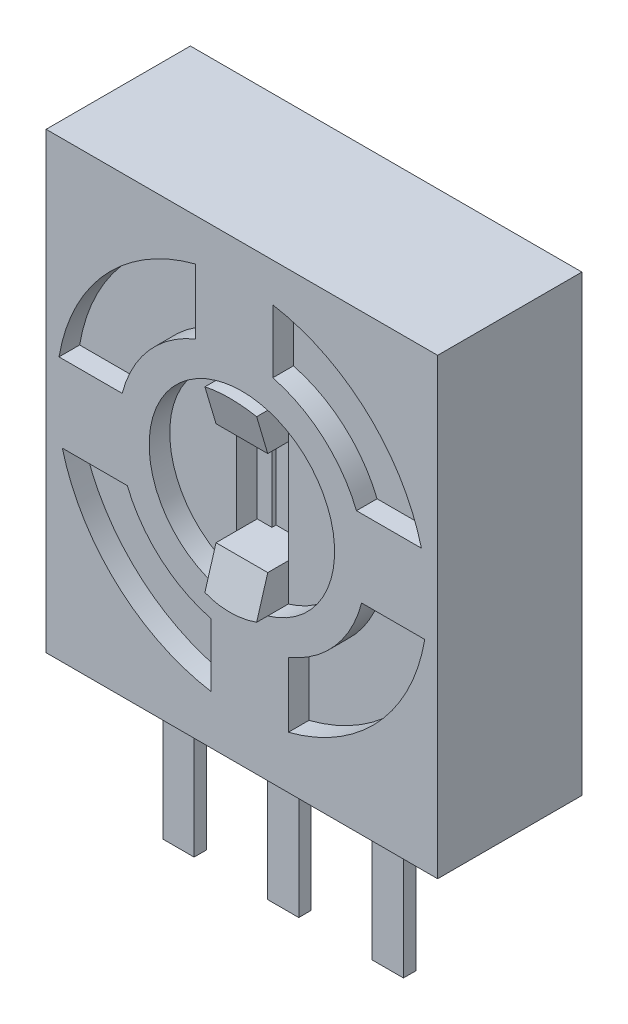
from build123d import *

# Parameters (mm, degrees)
ESQUISSE1_W             = 9.5
ESQUISSE1_H             = 11
EXTRUSION1_DEPTH        = 3.5
ESQUISSE2_R             = 2.25
ENL_V_MAT_EXTRU_1_DEPTH = 0.5
ESQUISSE3_W             = 0.76
ESQUISSE3_H             = 0.3
EXTRUSION2_DEPTH        = 3.5
EXTRUSION3_START        = 0.8
EXTRUSION3_DEPTH        = 0.8
ESQUISSE5_W             = 1.255482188
ESQUISSE5_H             = 2.5
ENL_V_MAT_EXTRU_2_DEPTH = 0.5
ENL_V_MAT_EXTRU_3_DEPTH = 0.1
ENL_V_MAT_EXTRU_4_DEPTH = 13.82030028


with BuildPart() as part:
    # Esquisse1 → Extrusion1 (new body)
    with BuildSketch(Plane.XY):
        with Locations((4.75, 5.5)):
            Rectangle(ESQUISSE1_W, ESQUISSE1_H)
    extrude(amount=EXTRUSION1_DEPTH)

    # Esquisse2 → Enl_v. mat.-Extru.1 (cut)
    with BuildSketch(Plane.XY.offset(3.5)):
        with Locations((4.75, 5.62345679)):
            Circle(ESQUISSE2_R)
        with BuildLine():
            Line((5.5, 10.060516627), (5.5, 8.5281943))
            ThreePointArc((5.5, 8.5281943), (6.726489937, 7.880332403), (7.530449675, 6.75))
            Line((7.530449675, 6.75), (9.106707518, 6.75))
            ThreePointArc((9.106707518, 6.75), (7.792941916, 8.93864977), (5.5, 10.060516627))
        make_face()
        with BuildLine():
            Line((9.187059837, 4.87345679), (7.65473751, 4.87345679))
            ThreePointArc((7.65473751, 4.87345679), (7.006875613, 3.646966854), (5.87654321, 2.843007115))
            Line((5.87654321, 2.843007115), (5.87654321, 1.266749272))
            ThreePointArc((5.87654321, 1.266749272), (8.06519298, 2.580514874), (9.187059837, 4.87345679))
        make_face()
        with BuildLine():
            Line((4, 1.186396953), (4, 2.71871928))
            ThreePointArc((4, 2.71871928), (2.773510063, 3.366581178), (1.969550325, 4.49691358))
            Line((1.969550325, 4.49691358), (0.393292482, 4.49691358))
            ThreePointArc((0.393292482, 4.49691358), (1.707058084, 2.30826381), (4, 1.186396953))
        make_face()
        with BuildLine():
            Line((0.312940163, 6.37345679), (1.84526249, 6.37345679))
            ThreePointArc((1.84526249, 6.37345679), (2.493124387, 7.599946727), (3.62345679, 8.403906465))
            Line((3.62345679, 8.403906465), (3.62345679, 9.980164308))
            ThreePointArc((3.62345679, 9.980164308), (1.43480702, 8.666398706), (0.312940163, 6.37345679))
        make_face()
    extrude(amount=-ENL_V_MAT_EXTRU_1_DEPTH, mode=Mode.SUBTRACT)

    # Esquisse3 → Extrusion2 (add)
    with BuildSketch(Plane.XZ):
        with Locations((4.75, 2.35)):
            Rectangle(ESQUISSE3_W, ESQUISSE3_H)
        with Locations((7.29, 2.35)):
            Rectangle(ESQUISSE3_W, ESQUISSE3_H)
        with Locations((2.21, 2.35)):
            Rectangle(ESQUISSE3_W, ESQUISSE3_H)
    extrude(amount=EXTRUSION2_DEPTH)

    # Esquisse4 → Extrusion3 (add)
    with BuildSketch(Plane.XY.offset(3).offset(EXTRUSION3_START)):
        with BuildLine():
            Line((4.122258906, 6.87345679), (5.377741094, 6.87345679))
            Line((5.377741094, 6.87345679), (5.377741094, 7.784114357))
            ThreePointArc((5.377741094, 7.784114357), (4.75, 7.87345679), (4.122258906, 7.784114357))
            Line((4.122258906, 7.784114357), (4.122258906, 6.87345679))
        make_face()
        with BuildLine():
            Line((4.122258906, 4.37345679), (5.377741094, 4.37345679))
            Line((5.377741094, 4.37345679), (5.377741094, 3.462799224))
            ThreePointArc((5.377741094, 3.462799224), (4.75, 3.37345679), (4.122258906, 3.462799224))
            Line((4.122258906, 3.462799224), (4.122258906, 4.37345679))
        make_face()
    extrude(amount=-EXTRUSION3_DEPTH)

    # Esquisse5 → Enl_v. mat.-Extru.2 (cut)
    with BuildSketch(Plane.XY.offset(3)):
        with Locations((4.75, 5.62345679)):
            Rectangle(ESQUISSE5_W, ESQUISSE5_H)
    extrude(amount=-ENL_V_MAT_EXTRU_2_DEPTH, mode=Mode.SUBTRACT)

    # Esquisse6 → Enl_v. mat.-Extru.3 (cut)
    with BuildSketch(Plane.XY.offset(2.5)):
        Polygon((4.75, 6.87345679), (4.122258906, 6.125078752), (4.479495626, 6.125078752), (4.479495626, 4.37345679), (5.020504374, 4.37345679), (5.020504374, 6.125078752), (5.377741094, 6.125078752), align=None)
    extrude(amount=-ENL_V_MAT_EXTRU_3_DEPTH, mode=Mode.SUBTRACT)

    # Esquisse7 → Enl_v. mat.-Extru.4 (cut, through all)
    with BuildSketch(Plane.ZY.offset(-4.122258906)):
        Polygon((3.5, 4.37345679), (3.831967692, 3.252162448), (4.346549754, 3.252162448), (4.346549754, 5.076594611), align=None)
        Polygon((4.346549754, 6.17031897), (3.5, 6.87345679), (3.831967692, 7.994751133), (4.346549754, 7.994751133), align=None)
    extrude(amount=-ENL_V_MAT_EXTRU_4_DEPTH, mode=Mode.SUBTRACT)


solid = part.part
